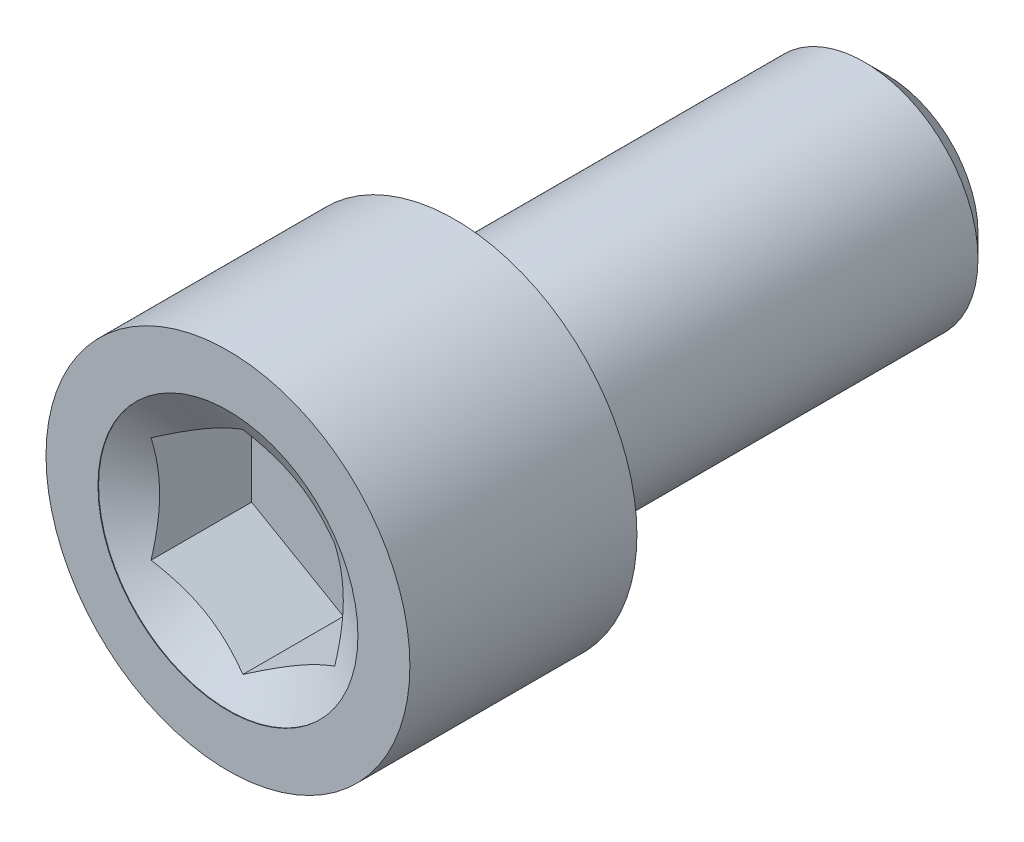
ISO-10303-21;
HEADER;
FILE_DESCRIPTION(('STEP AP214'),'2;1');
FILE_NAME('part.step','',(''),(''),'','','');
FILE_SCHEMA(('AUTOMOTIVE_DESIGN { 1 0 10303 214 1 1 1 1 }'));
ENDSEC;
DATA;
#1=APPLICATION_CONTEXT('core data for automotive mechanical design processes');
#2=APPLICATION_PROTOCOL_DEFINITION('international standard','automotive_design',2000,#1);
#3=PRODUCT_CONTEXT('',#1,'mechanical');
#4=PRODUCT('Part','Part','',(#3));
#5=PRODUCT_RELATED_PRODUCT_CATEGORY('part','',(#4));
#6=PRODUCT_DEFINITION_FORMATION('','',#4);
#7=PRODUCT_DEFINITION_CONTEXT('part definition',#1,'design');
#8=PRODUCT_DEFINITION('design','',#6,#7);
#9=PRODUCT_DEFINITION_SHAPE('','',#8);
#10=(LENGTH_UNIT() NAMED_UNIT(*) SI_UNIT(.MILLI.,.METRE.));
#11=(NAMED_UNIT(*) PLANE_ANGLE_UNIT() SI_UNIT($,.RADIAN.));
#12=(NAMED_UNIT(*) SI_UNIT($,.STERADIAN.) SOLID_ANGLE_UNIT());
#13=UNCERTAINTY_MEASURE_WITH_UNIT(LENGTH_MEASURE(1.E-05),#10,'distance_accuracy_value','');
#14=(GEOMETRIC_REPRESENTATION_CONTEXT(3) GLOBAL_UNCERTAINTY_ASSIGNED_CONTEXT((#13)) GLOBAL_UNIT_ASSIGNED_CONTEXT((#10,
#11,#12)) REPRESENTATION_CONTEXT('',''));
#15=CARTESIAN_POINT('',(0.,0.,0.));
#16=DIRECTION('',(0.,0.,1.));
#17=DIRECTION('',(1.,0.,0.));
#18=AXIS2_PLACEMENT_3D('',#15,#16,#17);
#19=CARTESIAN_POINT('',(0.,0.,0.));
#20=DIRECTION('',(0.,0.,-1.));
#21=DIRECTION('',(-1.,0.,0.));
#22=AXIS2_PLACEMENT_3D('',#19,#20,#21);
#23=PLANE('',#22);
#24=CARTESIAN_POINT('',(0.,0.,0.));
#25=DIRECTION('',(0.,0.,1.));
#26=DIRECTION('',(1.,0.,0.));
#27=AXIS2_PLACEMENT_3D('',#24,#25,#26);
#28=CIRCLE('',#27,8.001);
#29=CARTESIAN_POINT('',(8.001,0.,0.));
#30=VERTEX_POINT('',#29);
#31=EDGE_CURVE('E72',#30,#30,#28,.T.);
#32=ORIENTED_EDGE('',*,*,#31,.F.);
#33=EDGE_LOOP('',(#32));
#34=FACE_BOUND('',#33,.T.);
#35=CARTESIAN_POINT('',(0.,0.,0.));
#36=DIRECTION('',(0.,0.,-1.));
#37=DIRECTION('',(-1.,0.,0.));
#38=AXIS2_PLACEMENT_3D('',#35,#36,#37);
#39=CIRCLE('',#38,5.);
#40=CARTESIAN_POINT('',(-5.,0.,0.));
#41=VERTEX_POINT('',#40);
#42=EDGE_CURVE('E193',#41,#41,#39,.T.);
#43=ORIENTED_EDGE('',*,*,#42,.F.);
#44=EDGE_LOOP('',(#43));
#45=FACE_BOUND('',#44,.T.);
#46=ADVANCED_FACE('F14',(#34,#45),#23,.T.);
#47=CARTESIAN_POINT('',(0.,0.,9.9822));
#48=DIRECTION('',(0.,0.,1.));
#49=DIRECTION('',(1.,0.,0.));
#50=AXIS2_PLACEMENT_3D('',#47,#48,#49);
#51=PLANE('',#50);
#52=CARTESIAN_POINT('',(0.,0.,9.9822));
#53=DIRECTION('',(0.,0.,-1.));
#54=DIRECTION('',(-1.,0.,0.));
#55=AXIS2_PLACEMENT_3D('',#52,#53,#54);
#56=CIRCLE('',#55,5.715);
#57=CARTESIAN_POINT('',(-5.715,0.,9.9822));
#58=VERTEX_POINT('',#57);
#59=EDGE_CURVE('E195',#58,#58,#56,.T.);
#60=ORIENTED_EDGE('',*,*,#59,.T.);
#61=EDGE_LOOP('',(#60));
#62=FACE_BOUND('',#61,.T.);
#63=CARTESIAN_POINT('',(0.,0.,9.9822));
#64=DIRECTION('',(0.,0.,-1.));
#65=DIRECTION('',(-1.,0.,0.));
#66=AXIS2_PLACEMENT_3D('',#63,#64,#65);
#67=CIRCLE('',#66,8.001);
#68=CARTESIAN_POINT('',(-8.001,0.,9.9822));
#69=VERTEX_POINT('',#68);
#70=EDGE_CURVE('E99',#69,#69,#67,.T.);
#71=ORIENTED_EDGE('',*,*,#70,.F.);
#72=EDGE_LOOP('',(#71));
#73=FACE_BOUND('',#72,.T.);
#74=ADVANCED_FACE('F174',(#62,#73),#51,.T.);
#75=CARTESIAN_POINT('',(0.,0.,9.9822));
#76=DIRECTION('',(0.,0.,-1.));
#77=DIRECTION('',(-1.,0.,0.));
#78=AXIS2_PLACEMENT_3D('',#75,#76,#77);
#79=CYLINDRICAL_SURFACE('',#78,8.001);
#80=ORIENTED_EDGE('',*,*,#31,.T.);
#81=EDGE_LOOP('',(#80));
#82=FACE_BOUND('',#81,.T.);
#83=ORIENTED_EDGE('',*,*,#70,.T.);
#84=EDGE_LOOP('',(#83));
#85=FACE_BOUND('',#84,.T.);
#86=ADVANCED_FACE('F118',(#82,#85),#79,.T.);
#87=CARTESIAN_POINT('',(0.,0.,9.9568));
#88=DIRECTION('',(0.,0.,1.));
#89=DIRECTION('',(1.,0.,0.));
#90=AXIS2_PLACEMENT_3D('',#87,#88,#89);
#91=CONICAL_SURFACE('',#90,5.715,1.02974425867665);
#92=CARTESIAN_POINT('',(0.,0.,9.9568));
#93=DIRECTION('',(0.,0.,-1.));
#94=DIRECTION('',(-1.,0.,0.));
#95=AXIS2_PLACEMENT_3D('',#92,#93,#94);
#96=CIRCLE('',#95,5.715);
#97=CARTESIAN_POINT('',(-5.715,0.,9.9568));
#98=VERTEX_POINT('',#97);
#99=EDGE_CURVE('E78',#98,#98,#96,.T.);
#100=ORIENTED_EDGE('',*,*,#99,.F.);
#101=EDGE_LOOP('',(#100));
#102=FACE_BOUND('',#101,.T.);
#103=CARTESIAN_POINT('',(0.000200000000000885,4.66348906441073,9.32498849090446));
#104=CARTESIAN_POINT('',(-0.177918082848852,4.5606525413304,9.26317715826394));
#105=CARTESIAN_POINT('',(-0.357701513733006,4.4568545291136,9.20693667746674));
#106=CARTESIAN_POINT('',(-0.720651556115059,4.24730522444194,9.10879687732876));
#107=CARTESIAN_POINT('',(-0.903825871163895,4.14154948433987,9.06693596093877));
#108=CARTESIAN_POINT('',(-1.26771385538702,3.93145865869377,9.00200074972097));
#109=CARTESIAN_POINT('',(-1.44836169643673,3.8271615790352,8.97845256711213));
#110=CARTESIAN_POINT('',(-1.81055773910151,3.61804759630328,8.95063663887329));
#111=CARTESIAN_POINT('',(-1.99210438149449,3.51323159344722,8.94634270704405));
#112=CARTESIAN_POINT('',(-2.32970568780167,3.31831738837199,8.95663815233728));
#113=CARTESIAN_POINT('',(-2.48582334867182,3.22818281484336,8.9687051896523));
#114=CARTESIAN_POINT('',(-2.79695248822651,3.04855232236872,9.00650045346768));
#115=CARTESIAN_POINT('',(-2.95196269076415,2.95905714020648,9.03224246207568));
#116=CARTESIAN_POINT('',(-3.26376713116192,2.7790367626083,9.09642505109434));
#117=CARTESIAN_POINT('',(-3.42051564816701,2.68853796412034,9.13515404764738));
#118=CARTESIAN_POINT('',(-3.73150027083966,2.50899090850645,9.22289790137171));
#119=CARTESIAN_POINT('',(-3.88574103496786,2.41993996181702,9.27189057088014));
#120=CARTESIAN_POINT('',(-4.0388,2.33157132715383,9.32498849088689));
#121=B_SPLINE_CURVE_WITH_KNOTS('',3,(#103,#104,#105,#106,#107,#108,#109,#110,#111,#112,#113,
#114,#115,#116,#117,#118,#119,#120),.UNSPECIFIED.,.F.,.F.,(4,2,2,2,2,2,2,2,4),(0.,
0.644566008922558,1.29084029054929,1.91977596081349,2.54785600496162,3.08932428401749,
3.63133931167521,4.1862907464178,4.74005466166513),.UNSPECIFIED.);
#122=CARTESIAN_POINT('',(0.,4.66337359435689,9.32491910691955));
#123=VERTEX_POINT('',#122);
#124=CARTESIAN_POINT('',(-4.0386,2.33168679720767,9.32491910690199));
#125=VERTEX_POINT('',#124);
#126=EDGE_CURVE('E66',#123,#125,#121,.T.);
#127=ORIENTED_EDGE('',*,*,#126,.F.);
#128=CARTESIAN_POINT('',(4.0388,2.33157132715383,9.32498849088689));
#129=CARTESIAN_POINT('',(3.86068191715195,2.4344078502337,9.26317715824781));
#130=CARTESIAN_POINT('',(3.6808984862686,2.53820586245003,9.20693667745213));
#131=CARTESIAN_POINT('',(3.31794844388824,2.74775516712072,9.10879687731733));
#132=CARTESIAN_POINT('',(3.1347741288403,2.85351090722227,9.06693596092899));
#133=CARTESIAN_POINT('',(2.77088614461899,3.06360173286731,9.00200074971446));
#134=CARTESIAN_POINT('',(2.59023830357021,3.16789881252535,8.97845256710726));
#135=CARTESIAN_POINT('',(2.2280422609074,3.37701279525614,8.95063663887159));
#136=CARTESIAN_POINT('',(2.04649561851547,3.4818287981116,8.94634270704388));
#137=CARTESIAN_POINT('',(1.70889431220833,3.67674300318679,8.95663815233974));
#138=CARTESIAN_POINT('',(1.55277665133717,3.76687757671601,8.9687051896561));
#139=CARTESIAN_POINT('',(1.24164751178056,3.94650806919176,9.00650045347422));
#140=CARTESIAN_POINT('',(1.086637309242,4.03600325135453,9.03224246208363));
#141=CARTESIAN_POINT('',(0.774832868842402,4.21602362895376,9.0964250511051));
#142=CARTESIAN_POINT('',(0.618084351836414,4.30652242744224,9.13515404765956));
#143=CARTESIAN_POINT('',(0.307099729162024,4.48606948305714,9.22289790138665));
#144=CARTESIAN_POINT('',(0.152858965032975,4.57512042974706,9.27189057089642));
#145=CARTESIAN_POINT('',(-0.000199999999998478,4.66348906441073,9.32498849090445));
#146=B_SPLINE_CURVE_WITH_KNOTS('',3,(#128,#129,#130,#131,#132,#133,#134,#135,#136,#137,#138,
#139,#140,#141,#142,#143,#144,#145),.UNSPECIFIED.,.F.,.F.,(4,2,2,2,2,2,2,2,4),(0.,
0.644566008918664,1.2908402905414,1.91977596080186,2.54785600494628,3.0893242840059,
3.63133931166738,4.18629074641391,4.74005466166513),.UNSPECIFIED.);
#147=CARTESIAN_POINT('',(4.0386,2.33168679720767,9.324919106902));
#148=VERTEX_POINT('',#147);
#149=EDGE_CURVE('E68',#148,#123,#146,.T.);
#150=ORIENTED_EDGE('',*,*,#149,.F.);
#151=CARTESIAN_POINT('',(4.0386,-6.16408723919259,10.9507906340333));
#152=CARTESIAN_POINT('',(4.0386,-5.98935792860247,10.8629975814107));
#153=CARTESIAN_POINT('',(4.0386,-5.81419177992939,10.7760585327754));
#154=CARTESIAN_POINT('',(4.0386,-5.46275221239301,10.6043718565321));
#155=CARTESIAN_POINT('',(4.0386,-5.28647860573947,10.5196246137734));
#156=CARTESIAN_POINT('',(4.0386,-4.93157157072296,10.3523269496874));
#157=CARTESIAN_POINT('',(4.0386,-4.75293030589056,10.2697930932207));
#158=CARTESIAN_POINT('',(4.0386,-4.3940993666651,10.1081762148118));
#159=CARTESIAN_POINT('',(4.0386,-4.21390977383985,10.0290930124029));
#160=CARTESIAN_POINT('',(4.0386,-3.84588487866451,9.87284081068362));
#161=CARTESIAN_POINT('',(4.0386,-3.65798909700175,9.79581345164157));
#162=CARTESIAN_POINT('',(4.0386,-3.27980617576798,9.64775156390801));
#163=CARTESIAN_POINT('',(4.0386,-3.0895187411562,9.57671778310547));
#164=CARTESIAN_POINT('',(4.0386,-2.7066300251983,9.44259420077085));
#165=CARTESIAN_POINT('',(4.0386,-2.51403511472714,9.37948640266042));
#166=CARTESIAN_POINT('',(4.0386,-2.12586955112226,9.26331435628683));
#167=CARTESIAN_POINT('',(4.0386,-1.93029997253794,9.21024657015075));
#168=CARTESIAN_POINT('',(4.0386,-1.53668673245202,9.11698077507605));
#169=CARTESIAN_POINT('',(4.0386,-1.33865243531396,9.076744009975));
#170=CARTESIAN_POINT('',(4.0386,-0.940022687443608,9.01172266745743));
#171=CARTESIAN_POINT('',(4.0386,-0.739427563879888,8.98693613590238));
#172=CARTESIAN_POINT('',(4.0386,-0.339543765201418,8.9552080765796));
#173=CARTESIAN_POINT('',(4.0386,-0.14027448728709,8.94802818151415));
#174=CARTESIAN_POINT('',(4.0386,0.258130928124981,8.95152294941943));
#175=CARTESIAN_POINT('',(4.0386,0.457267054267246,8.96219897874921));
#176=CARTESIAN_POINT('',(4.0386,0.790809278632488,8.99429293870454));
#177=CARTESIAN_POINT('',(4.0386,0.925673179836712,9.01121848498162));
#178=CARTESIAN_POINT('',(4.0386,1.19432190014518,9.05219992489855));
#179=CARTESIAN_POINT('',(4.0386,1.32810656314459,9.07625683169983));
#180=CARTESIAN_POINT('',(4.0386,1.72772112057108,9.15794645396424));
#181=CARTESIAN_POINT('',(4.0386,1.99162896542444,9.22507846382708));
#182=CARTESIAN_POINT('',(4.0386,2.38633460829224,9.3406074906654));
#183=CARTESIAN_POINT('',(4.0386,2.51924927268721,9.38216281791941));
#184=CARTESIAN_POINT('',(4.0386,2.78365711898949,9.46935602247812));
#185=CARTESIAN_POINT('',(4.0386,2.91515109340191,9.51499147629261));
#186=CARTESIAN_POINT('',(4.0386,3.17687398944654,9.60968567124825));
#187=CARTESIAN_POINT('',(4.0386,3.30710304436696,9.65874404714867));
#188=CARTESIAN_POINT('',(4.0386,3.56645930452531,9.75974066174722));
#189=CARTESIAN_POINT('',(4.0386,3.69558633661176,9.81167934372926));
#190=CARTESIAN_POINT('',(4.0386,4.05002248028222,9.95810255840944));
#191=CARTESIAN_POINT('',(4.0386,4.27429832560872,10.0550864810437));
#192=CARTESIAN_POINT('',(4.0386,4.72041043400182,10.2545309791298));
#193=CARTESIAN_POINT('',(4.0386,4.94224641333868,10.3569921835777));
#194=CARTESIAN_POINT('',(4.0386,5.3840233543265,10.5660744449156));
#195=CARTESIAN_POINT('',(4.0386,5.60396373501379,10.6726967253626));
#196=CARTESIAN_POINT('',(4.0386,6.04228216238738,10.8891121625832));
#197=CARTESIAN_POINT('',(4.0386,6.26066016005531,10.9989054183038));
#198=CARTESIAN_POINT('',(4.0386,6.69651370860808,11.2211457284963));
#199=CARTESIAN_POINT('',(4.0386,6.91398717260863,11.3335968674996));
#200=CARTESIAN_POINT('',(4.0386,7.34790616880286,11.5604672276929));
#201=CARTESIAN_POINT('',(4.0386,7.56435168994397,11.6748864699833));
#202=CARTESIAN_POINT('',(4.0386,8.21234215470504,12.0204438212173));
#203=CARTESIAN_POINT('',(4.0386,8.64263452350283,12.2539297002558));
#204=CARTESIAN_POINT('',(4.0386,9.45396690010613,12.6993040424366));
#205=CARTESIAN_POINT('',(4.0386,9.83524506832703,12.9107607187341));
#206=CARTESIAN_POINT('',(4.0386,10.5964653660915,13.3361160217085));
#207=CARTESIAN_POINT('',(4.0386,10.9764074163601,13.5500147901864));
#208=CARTESIAN_POINT('',(4.0386,11.7339661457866,13.9788853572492));
#209=CARTESIAN_POINT('',(4.0386,12.1115863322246,14.1938509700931));
#210=CARTESIAN_POINT('',(4.0386,12.8659956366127,14.6251701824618));
#211=CARTESIAN_POINT('',(4.0386,13.2427848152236,14.841523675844));
#212=CARTESIAN_POINT('',(4.0386,13.6192807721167,15.0583831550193));
#213=B_SPLINE_CURVE_WITH_KNOTS('',3,(#151,#152,#153,#154,#155,#156,#157,#158,#159,#160,#161,
#162,#163,#164,#165,#166,#167,#168,#169,#170,#171,#172,#173,#174,#175,#176,#177,#178,#179,#180,
#181,#182,#183,#184,#185,#186,#187,#188,#189,#190,#191,#192,#193,#194,#195,#196,#197,#198,#199,
#200,#201,#202,#203,#204,#205,#206,#207,#208,#209,#210,#211,#212),.UNSPECIFIED.,.F.,.F.,(4,2,2,
2,2,2,2,2,2,2,2,2,2,2,2,2,2,2,2,2,2,2,2,2,2,2,2,2,2,2,4),(0.,0.586643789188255,1.17338989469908,
1.76371711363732,2.35401342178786,2.96314877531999,3.57236002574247,4.18016199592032,
4.7877493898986,5.39348378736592,5.99914155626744,6.59655321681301,7.19401059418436,
7.6015836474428,8.00921463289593,8.82502515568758,9.2427675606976,9.66026346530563,
10.0777148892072,10.4952307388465,11.2281615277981,11.9611766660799,12.6944089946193,
13.4276642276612,14.1621308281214,14.896605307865,16.3652387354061,17.6731986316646,
18.9812348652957,20.2847903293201,21.5882472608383),.UNSPECIFIED.);
#214=CARTESIAN_POINT('',(4.0386,-2.33168679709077,9.32491910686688));
#215=VERTEX_POINT('',#214);
#216=EDGE_CURVE('E77',#215,#148,#213,.T.);
#217=ORIENTED_EDGE('',*,*,#216,.F.);
#218=CARTESIAN_POINT('',(-0.000199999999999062,-4.66348906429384,9.32498849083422));
#219=CARTESIAN_POINT('',(0.177918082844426,-4.56065254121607,9.26317715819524));
#220=CARTESIAN_POINT('',(0.35770151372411,-4.45685452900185,9.20693667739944));
#221=CARTESIAN_POINT('',(0.720651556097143,-4.24730522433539,9.10879687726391));
#222=CARTESIAN_POINT('',(0.903825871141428,-4.14154948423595,9.06693596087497));
#223=CARTESIAN_POINT('',(1.26771385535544,-3.93145865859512,9.0020007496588));
#224=CARTESIAN_POINT('',(1.44836169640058,-3.82716157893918,8.97845256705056));
#225=CARTESIAN_POINT('',(1.8105577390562,-3.61804759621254,8.95063663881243));
#226=CARTESIAN_POINT('',(1.99210438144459,-3.51323159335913,8.94634270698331));
#227=CARTESIAN_POINT('',(2.32970568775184,-3.31831738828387,8.95663815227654));
#228=CARTESIAN_POINT('',(2.48582334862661,-3.22818281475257,8.96870518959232));
#229=CARTESIAN_POINT('',(2.79695248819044,-3.04855232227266,9.00650045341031));
#230=CARTESIAN_POINT('',(2.95196269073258,-2.95905714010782,9.03224246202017));
#231=CARTESIAN_POINT('',(3.26376713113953,-2.77903676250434,9.09642505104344));
#232=CARTESIAN_POINT('',(3.42051564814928,-2.68853796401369,9.13515404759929));
#233=CARTESIAN_POINT('',(3.73150027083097,-2.50899090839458,9.22289790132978));
#234=CARTESIAN_POINT('',(3.88574103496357,-2.41993996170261,9.27189057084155));
#235=CARTESIAN_POINT('',(4.0388,-2.33157132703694,9.32498849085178));
#236=B_SPLINE_CURVE_WITH_KNOTS('',3,(#218,#219,#220,#221,#222,#223,#224,#225,#226,#227,#228,
#229,#230,#231,#232,#233,#234,#235),.UNSPECIFIED.,.F.,.F.,(4,2,2,2,2,2,2,2,4),(0.,
0.644566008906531,1.29084029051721,1.91977596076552,2.54785600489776,3.0893242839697,
3.6313393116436,4.18629074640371,4.74005466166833),.UNSPECIFIED.);
#237=CARTESIAN_POINT('',(0.,-4.66337359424,9.32491910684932));
#238=VERTEX_POINT('',#237);
#239=EDGE_CURVE('E139',#238,#215,#236,.T.);
#240=ORIENTED_EDGE('',*,*,#239,.F.);
#241=CARTESIAN_POINT('',(-4.0388,-2.33157132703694,9.32498849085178));
#242=CARTESIAN_POINT('',(-3.86068191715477,-2.43440785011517,9.26317715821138));
#243=CARTESIAN_POINT('',(-3.68089848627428,-2.53820586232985,9.20693667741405));
#244=CARTESIAN_POINT('',(-3.31794844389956,-2.74775516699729,9.10879687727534));
#245=CARTESIAN_POINT('',(-3.13477412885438,-2.85351090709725,9.06693596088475));
#246=CARTESIAN_POINT('',(-2.77088614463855,-3.06360173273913,9.00200074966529));
#247=CARTESIAN_POINT('',(-2.59023830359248,-3.1678988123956,8.97845256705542));
#248=CARTESIAN_POINT('',(-2.22804226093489,-3.37701279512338,8.95063663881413));
#249=CARTESIAN_POINT('',(-2.04649561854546,-3.48182879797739,8.94634270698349));
#250=CARTESIAN_POINT('',(-1.70889431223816,-3.67674300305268,8.95663815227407));
#251=CARTESIAN_POINT('',(-1.55277665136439,-3.7668775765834,8.96870518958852));
#252=CARTESIAN_POINT('',(-1.2416475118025,-3.9465080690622,9.00650045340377));
#253=CARTESIAN_POINT('',(-1.08663730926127,-4.03600325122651,9.03224246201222));
#254=CARTESIAN_POINT('',(-0.774832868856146,-4.21602362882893,9.09642505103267));
#255=CARTESIAN_POINT('',(-0.618084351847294,-4.30652242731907,9.1351540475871));
#256=CARTESIAN_POINT('',(-0.30709972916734,-4.48606948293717,9.22289790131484));
#257=CARTESIAN_POINT('',(-0.152858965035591,-4.57512042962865,9.27189057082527));
#258=CARTESIAN_POINT('',(0.000200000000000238,-4.66348906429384,9.32498849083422));
#259=B_SPLINE_CURVE_WITH_KNOTS('',3,(#241,#242,#243,#244,#245,#246,#247,#248,#249,#250,#251,
#252,#253,#254,#255,#256,#257,#258),.UNSPECIFIED.,.F.,.F.,(4,2,2,2,2,2,2,2,4),(0.,
0.644566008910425,1.2908402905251,1.91977596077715,2.54785600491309,3.08932428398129,
3.63133931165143,4.1862907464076,4.74005466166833),.UNSPECIFIED.);
#260=CARTESIAN_POINT('',(-4.0386,-2.33168679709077,9.32491910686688));
#261=VERTEX_POINT('',#260);
#262=EDGE_CURVE('E146',#261,#238,#259,.T.);
#263=ORIENTED_EDGE('',*,*,#262,.F.);
#264=CARTESIAN_POINT('',(-4.0386,-6.16408723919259,10.9507906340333));
#265=CARTESIAN_POINT('',(-4.0386,-5.98935792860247,10.8629975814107));
#266=CARTESIAN_POINT('',(-4.0386,-5.81419177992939,10.7760585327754));
#267=CARTESIAN_POINT('',(-4.0386,-5.46275221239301,10.6043718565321));
#268=CARTESIAN_POINT('',(-4.0386,-5.28647860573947,10.5196246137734));
#269=CARTESIAN_POINT('',(-4.0386,-4.93157157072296,10.3523269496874));
#270=CARTESIAN_POINT('',(-4.0386,-4.75293030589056,10.2697930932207));
#271=CARTESIAN_POINT('',(-4.0386,-4.3940993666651,10.1081762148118));
#272=CARTESIAN_POINT('',(-4.0386,-4.21390977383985,10.0290930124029));
#273=CARTESIAN_POINT('',(-4.0386,-3.84588487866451,9.87284081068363));
#274=CARTESIAN_POINT('',(-4.0386,-3.65798909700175,9.79581345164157));
#275=CARTESIAN_POINT('',(-4.0386,-3.27980617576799,9.64775156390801));
#276=CARTESIAN_POINT('',(-4.0386,-3.0895187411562,9.57671778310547));
#277=CARTESIAN_POINT('',(-4.0386,-2.7066300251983,9.44259420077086));
#278=CARTESIAN_POINT('',(-4.0386,-2.51403511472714,9.37948640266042));
#279=CARTESIAN_POINT('',(-4.0386,-2.12586955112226,9.26331435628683));
#280=CARTESIAN_POINT('',(-4.0386,-1.93029997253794,9.21024657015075));
#281=CARTESIAN_POINT('',(-4.0386,-1.53668673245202,9.11698077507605));
#282=CARTESIAN_POINT('',(-4.0386,-1.33865243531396,9.076744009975));
#283=CARTESIAN_POINT('',(-4.0386,-0.940022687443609,9.01172266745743));
#284=CARTESIAN_POINT('',(-4.0386,-0.739427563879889,8.98693613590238));
#285=CARTESIAN_POINT('',(-4.0386,-0.33954376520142,8.9552080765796));
#286=CARTESIAN_POINT('',(-4.0386,-0.140274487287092,8.94802818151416));
#287=CARTESIAN_POINT('',(-4.0386,0.258130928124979,8.95152294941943));
#288=CARTESIAN_POINT('',(-4.0386,0.457267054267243,8.96219897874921));
#289=CARTESIAN_POINT('',(-4.0386,0.790809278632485,8.99429293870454));
#290=CARTESIAN_POINT('',(-4.0386,0.925673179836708,9.01121848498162));
#291=CARTESIAN_POINT('',(-4.0386,1.19432190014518,9.05219992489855));
#292=CARTESIAN_POINT('',(-4.0386,1.32810656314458,9.07625683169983));
#293=CARTESIAN_POINT('',(-4.0386,1.72772112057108,9.15794645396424));
#294=CARTESIAN_POINT('',(-4.0386,1.99162896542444,9.22507846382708));
#295=CARTESIAN_POINT('',(-4.0386,2.38633460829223,9.3406074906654));
#296=CARTESIAN_POINT('',(-4.0386,2.5192492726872,9.38216281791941));
#297=CARTESIAN_POINT('',(-4.0386,2.78365711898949,9.46935602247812));
#298=CARTESIAN_POINT('',(-4.0386,2.91515109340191,9.51499147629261));
#299=CARTESIAN_POINT('',(-4.0386,3.17687398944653,9.60968567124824));
#300=CARTESIAN_POINT('',(-4.0386,3.30710304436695,9.65874404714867));
#301=CARTESIAN_POINT('',(-4.0386,3.5664593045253,9.75974066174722));
#302=CARTESIAN_POINT('',(-4.0386,3.69558633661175,9.81167934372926));
#303=CARTESIAN_POINT('',(-4.0386,4.05002248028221,9.95810255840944));
#304=CARTESIAN_POINT('',(-4.0386,4.27429832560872,10.0550864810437));
#305=CARTESIAN_POINT('',(-4.0386,4.72041043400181,10.2545309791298));
#306=CARTESIAN_POINT('',(-4.0386,4.94224641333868,10.3569921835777));
#307=CARTESIAN_POINT('',(-4.0386,5.38402335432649,10.5660744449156));
#308=CARTESIAN_POINT('',(-4.0386,5.60396373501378,10.6726967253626));
#309=CARTESIAN_POINT('',(-4.0386,6.04228216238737,10.8891121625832));
#310=CARTESIAN_POINT('',(-4.0386,6.2606601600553,10.9989054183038));
#311=CARTESIAN_POINT('',(-4.0386,6.69651370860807,11.2211457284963));
#312=CARTESIAN_POINT('',(-4.0386,6.91398717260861,11.3335968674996));
#313=CARTESIAN_POINT('',(-4.0386,7.34790616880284,11.5604672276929));
#314=CARTESIAN_POINT('',(-4.0386,7.56435168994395,11.6748864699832));
#315=CARTESIAN_POINT('',(-4.0386,8.21234215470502,12.0204438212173));
#316=CARTESIAN_POINT('',(-4.0386,8.64263452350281,12.2539297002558));
#317=CARTESIAN_POINT('',(-4.0386,9.4539669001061,12.6993040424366));
#318=CARTESIAN_POINT('',(-4.0386,9.83524506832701,12.9107607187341));
#319=CARTESIAN_POINT('',(-4.0386,10.5964653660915,13.3361160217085));
#320=CARTESIAN_POINT('',(-4.0386,10.9764074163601,13.5500147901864));
#321=CARTESIAN_POINT('',(-4.0386,11.7339661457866,13.9788853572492));
#322=CARTESIAN_POINT('',(-4.0386,12.1115863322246,14.1938509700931));
#323=CARTESIAN_POINT('',(-4.0386,12.8659956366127,14.6251701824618));
#324=CARTESIAN_POINT('',(-4.0386,13.2427848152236,14.841523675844));
#325=CARTESIAN_POINT('',(-4.0386,13.6192807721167,15.0583831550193));
#326=B_SPLINE_CURVE_WITH_KNOTS('',3,(#264,#265,#266,#267,#268,#269,#270,#271,#272,#273,#274,
#275,#276,#277,#278,#279,#280,#281,#282,#283,#284,#285,#286,#287,#288,#289,#290,#291,#292,#293,
#294,#295,#296,#297,#298,#299,#300,#301,#302,#303,#304,#305,#306,#307,#308,#309,#310,#311,#312,
#313,#314,#315,#316,#317,#318,#319,#320,#321,#322,#323,#324,#325),.UNSPECIFIED.,.F.,.F.,(4,2,2,
2,2,2,2,2,2,2,2,2,2,2,2,2,2,2,2,2,2,2,2,2,2,2,2,2,2,2,4),(0.,0.586643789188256,1.17338989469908,
1.76371711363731,2.35401342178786,2.96314877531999,3.57236002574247,4.18016199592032,
4.7877493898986,5.39348378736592,5.99914155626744,6.59655321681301,7.19401059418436,
7.60158364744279,8.00921463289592,8.82502515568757,9.2427675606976,9.66026346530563,
10.0777148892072,10.4952307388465,11.228161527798,11.9611766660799,12.6944089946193,
13.4276642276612,14.1621308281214,14.896605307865,16.365238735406,17.6731986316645,
18.9812348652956,20.2847903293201,21.5882472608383),.UNSPECIFIED.);
#327=EDGE_CURVE('E29',#125,#261,#326,.F.);
#328=ORIENTED_EDGE('',*,*,#327,.F.);
#329=EDGE_LOOP('',(#127,#150,#217,#240,#263,#328));
#330=FACE_BOUND('',#329,.T.);
#331=ADVANCED_FACE('F67',(#102,#330),#91,.F.);
#332=CARTESIAN_POINT('',(0.,0.,9.9822));
#333=DIRECTION('',(0.,0.,-1.));
#334=DIRECTION('',(-1.,0.,0.));
#335=AXIS2_PLACEMENT_3D('',#332,#333,#334);
#336=CYLINDRICAL_SURFACE('',#335,5.715);
#337=ORIENTED_EDGE('',*,*,#99,.T.);
#338=EDGE_LOOP('',(#337));
#339=FACE_BOUND('',#338,.T.);
#340=ORIENTED_EDGE('',*,*,#59,.F.);
#341=EDGE_LOOP('',(#340));
#342=FACE_BOUND('',#341,.T.);
#343=ADVANCED_FACE('F117',(#339,#342),#336,.F.);
#344=CARTESIAN_POINT('',(-4.0386,-2.33168679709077,4.9022));
#345=DIRECTION('',(0.,0.,1.));
#346=DIRECTION('',(1.,0.,0.));
#347=AXIS2_PLACEMENT_3D('',#344,#345,#346);
#348=PLANE('',#347);
#349=DIRECTION('',(0.,-1.,0.));
#350=VECTOR('',#349,1.);
#351=CARTESIAN_POINT('',(-4.0386,2.33168679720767,4.9022));
#352=LINE('',#351,#350);
#353=CARTESIAN_POINT('',(-4.0386,2.33168679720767,4.9022));
#354=VERTEX_POINT('',#353);
#355=CARTESIAN_POINT('',(-4.0386,-2.33168679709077,4.9022));
#356=VERTEX_POINT('',#355);
#357=EDGE_CURVE('E218',#354,#356,#352,.T.);
#358=ORIENTED_EDGE('',*,*,#357,.T.);
#359=DIRECTION('',(0.866025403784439,-0.5,0.));
#360=VECTOR('',#359,1.);
#361=CARTESIAN_POINT('',(-4.0386,-2.33168679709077,4.9022));
#362=LINE('',#361,#360);
#363=CARTESIAN_POINT('',(0.,-4.66337359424,4.9022));
#364=VERTEX_POINT('',#363);
#365=EDGE_CURVE('E221',#356,#364,#362,.T.);
#366=ORIENTED_EDGE('',*,*,#365,.T.);
#367=DIRECTION('',(0.866025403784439,0.5,0.));
#368=VECTOR('',#367,1.);
#369=CARTESIAN_POINT('',(0.,-4.66337359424,4.9022));
#370=LINE('',#369,#368);
#371=CARTESIAN_POINT('',(4.0386,-2.33168679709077,4.9022));
#372=VERTEX_POINT('',#371);
#373=EDGE_CURVE('E223',#364,#372,#370,.T.);
#374=ORIENTED_EDGE('',*,*,#373,.T.);
#375=DIRECTION('',(0.,1.,0.));
#376=VECTOR('',#375,1.);
#377=CARTESIAN_POINT('',(4.0386,-2.33168679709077,4.9022));
#378=LINE('',#377,#376);
#379=CARTESIAN_POINT('',(4.0386,2.33168679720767,4.9022));
#380=VERTEX_POINT('',#379);
#381=EDGE_CURVE('E227',#372,#380,#378,.T.);
#382=ORIENTED_EDGE('',*,*,#381,.T.);
#383=DIRECTION('',(-0.866025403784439,0.5,0.));
#384=VECTOR('',#383,1.);
#385=CARTESIAN_POINT('',(4.0386,2.33168679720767,4.9022));
#386=LINE('',#385,#384);
#387=CARTESIAN_POINT('',(0.,4.66337359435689,4.9022));
#388=VERTEX_POINT('',#387);
#389=EDGE_CURVE('E229',#380,#388,#386,.T.);
#390=ORIENTED_EDGE('',*,*,#389,.T.);
#391=DIRECTION('',(-0.866025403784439,-0.5,0.));
#392=VECTOR('',#391,1.);
#393=CARTESIAN_POINT('',(0.,4.66337359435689,4.9022));
#394=LINE('',#393,#392);
#395=EDGE_CURVE('E83',#388,#354,#394,.T.);
#396=ORIENTED_EDGE('',*,*,#395,.T.);
#397=EDGE_LOOP('',(#358,#366,#374,#382,#390,#396));
#398=FACE_BOUND('',#397,.T.);
#399=ADVANCED_FACE('F204',(#398),#348,.T.);
#400=CARTESIAN_POINT('',(0.,4.66337359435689,4.9022));
#401=DIRECTION('',(-0.5,0.866025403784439,0.));
#402=DIRECTION('',(0.866025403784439,0.5,0.));
#403=AXIS2_PLACEMENT_3D('',#400,#401,#402);
#404=PLANE('',#403);
#405=DIRECTION('',(0.,0.,1.));
#406=VECTOR('',#405,1.);
#407=CARTESIAN_POINT('',(0.,4.66337359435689,4.9022));
#408=LINE('',#407,#406);
#409=EDGE_CURVE('E37',#388,#123,#408,.T.);
#410=ORIENTED_EDGE('',*,*,#409,.T.);
#411=ORIENTED_EDGE('',*,*,#126,.T.);
#412=DIRECTION('',(0.,0.,1.));
#413=VECTOR('',#412,1.);
#414=CARTESIAN_POINT('',(-4.0386,2.33168679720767,4.9022));
#415=LINE('',#414,#413);
#416=EDGE_CURVE('E84',#354,#125,#415,.T.);
#417=ORIENTED_EDGE('',*,*,#416,.F.);
#418=ORIENTED_EDGE('',*,*,#395,.F.);
#419=EDGE_LOOP('',(#410,#411,#417,#418));
#420=FACE_BOUND('',#419,.T.);
#421=ADVANCED_FACE('F81',(#420),#404,.F.);
#422=CARTESIAN_POINT('',(4.0386,2.33168679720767,4.9022));
#423=DIRECTION('',(0.5,0.866025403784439,0.));
#424=DIRECTION('',(0.866025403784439,-0.5,0.));
#425=AXIS2_PLACEMENT_3D('',#422,#423,#424);
#426=PLANE('',#425);
#427=DIRECTION('',(0.,0.,1.));
#428=VECTOR('',#427,1.);
#429=CARTESIAN_POINT('',(4.0386,2.33168679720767,4.9022));
#430=LINE('',#429,#428);
#431=EDGE_CURVE('E76',#380,#148,#430,.T.);
#432=ORIENTED_EDGE('',*,*,#431,.T.);
#433=ORIENTED_EDGE('',*,*,#149,.T.);
#434=ORIENTED_EDGE('',*,*,#409,.F.);
#435=ORIENTED_EDGE('',*,*,#389,.F.);
#436=EDGE_LOOP('',(#432,#433,#434,#435));
#437=FACE_BOUND('',#436,.T.);
#438=ADVANCED_FACE('F75',(#437),#426,.F.);
#439=CARTESIAN_POINT('',(4.0386,-2.33168679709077,4.9022));
#440=DIRECTION('',(1.,0.,0.));
#441=DIRECTION('',(0.,0.,-1.));
#442=AXIS2_PLACEMENT_3D('',#439,#440,#441);
#443=PLANE('',#442);
#444=DIRECTION('',(0.,0.,1.));
#445=VECTOR('',#444,1.);
#446=CARTESIAN_POINT('',(4.0386,-2.33168679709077,4.9022));
#447=LINE('',#446,#445);
#448=EDGE_CURVE('E86',#372,#215,#447,.T.);
#449=ORIENTED_EDGE('',*,*,#448,.T.);
#450=ORIENTED_EDGE('',*,*,#216,.T.);
#451=ORIENTED_EDGE('',*,*,#431,.F.);
#452=ORIENTED_EDGE('',*,*,#381,.F.);
#453=EDGE_LOOP('',(#449,#450,#451,#452));
#454=FACE_BOUND('',#453,.T.);
#455=ADVANCED_FACE('F232',(#454),#443,.F.);
#456=CARTESIAN_POINT('',(0.,-4.66337359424,4.9022));
#457=DIRECTION('',(0.5,-0.866025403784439,0.));
#458=DIRECTION('',(-0.866025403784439,-0.5,0.));
#459=AXIS2_PLACEMENT_3D('',#456,#457,#458);
#460=PLANE('',#459);
#461=DIRECTION('',(0.,0.,1.));
#462=VECTOR('',#461,1.);
#463=CARTESIAN_POINT('',(0.,-4.66337359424,4.9022));
#464=LINE('',#463,#462);
#465=EDGE_CURVE('E94',#364,#238,#464,.T.);
#466=ORIENTED_EDGE('',*,*,#465,.T.);
#467=ORIENTED_EDGE('',*,*,#239,.T.);
#468=ORIENTED_EDGE('',*,*,#448,.F.);
#469=ORIENTED_EDGE('',*,*,#373,.F.);
#470=EDGE_LOOP('',(#466,#467,#468,#469));
#471=FACE_BOUND('',#470,.T.);
#472=ADVANCED_FACE('F163',(#471),#460,.F.);
#473=CARTESIAN_POINT('',(-4.0386,-2.33168679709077,4.9022));
#474=DIRECTION('',(-0.5,-0.866025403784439,0.));
#475=DIRECTION('',(-0.866025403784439,0.5,0.));
#476=AXIS2_PLACEMENT_3D('',#473,#474,#475);
#477=PLANE('',#476);
#478=DIRECTION('',(0.,0.,1.));
#479=VECTOR('',#478,1.);
#480=CARTESIAN_POINT('',(-4.0386,-2.33168679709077,4.9022));
#481=LINE('',#480,#479);
#482=EDGE_CURVE('E97',#356,#261,#481,.T.);
#483=ORIENTED_EDGE('',*,*,#482,.T.);
#484=ORIENTED_EDGE('',*,*,#262,.T.);
#485=ORIENTED_EDGE('',*,*,#465,.F.);
#486=ORIENTED_EDGE('',*,*,#365,.F.);
#487=EDGE_LOOP('',(#483,#484,#485,#486));
#488=FACE_BOUND('',#487,.T.);
#489=ADVANCED_FACE('F159',(#488),#477,.F.);
#490=CARTESIAN_POINT('',(-4.0386,2.33168679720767,4.9022));
#491=DIRECTION('',(-1.,0.,0.));
#492=DIRECTION('',(0.,0.,1.));
#493=AXIS2_PLACEMENT_3D('',#490,#491,#492);
#494=PLANE('',#493);
#495=ORIENTED_EDGE('',*,*,#416,.T.);
#496=ORIENTED_EDGE('',*,*,#327,.T.);
#497=ORIENTED_EDGE('',*,*,#482,.F.);
#498=ORIENTED_EDGE('',*,*,#357,.F.);
#499=EDGE_LOOP('',(#495,#496,#497,#498));
#500=FACE_BOUND('',#499,.T.);
#501=ADVANCED_FACE('F162',(#500),#494,.F.);
#502=CARTESIAN_POINT('',(0.,0.,-33.141335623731));
#503=DIRECTION('',(0.,0.,1.));
#504=DIRECTION('',(1.,0.,0.));
#505=AXIS2_PLACEMENT_3D('',#502,#503,#504);
#506=CYLINDRICAL_SURFACE('',#505,5.);
#507=CARTESIAN_POINT('',(0.,0.,-17.9992));
#508=DIRECTION('',(0.,0.,-1.));
#509=DIRECTION('',(-1.,0.,0.));
#510=AXIS2_PLACEMENT_3D('',#507,#508,#509);
#511=CIRCLE('',#510,5.);
#512=CARTESIAN_POINT('',(-5.,0.,-17.9992));
#513=VERTEX_POINT('',#512);
#514=EDGE_CURVE('E9',#513,#513,#511,.F.);
#515=ORIENTED_EDGE('',*,*,#514,.T.);
#516=EDGE_LOOP('',(#515));
#517=FACE_BOUND('',#516,.T.);
#518=ORIENTED_EDGE('',*,*,#42,.T.);
#519=EDGE_LOOP('',(#518));
#520=FACE_BOUND('',#519,.T.);
#521=ADVANCED_FACE('F120',(#517,#520),#506,.T.);
#522=CARTESIAN_POINT('',(0.,0.,-18.9992));
#523=DIRECTION('',(0.,0.,-1.));
#524=DIRECTION('',(-1.,0.,0.));
#525=AXIS2_PLACEMENT_3D('',#522,#523,#524);
#526=PLANE('',#525);
#527=CARTESIAN_POINT('',(0.,0.,-18.9992));
#528=DIRECTION('',(0.,0.,-1.));
#529=DIRECTION('',(-1.,0.,0.));
#530=AXIS2_PLACEMENT_3D('',#527,#528,#529);
#531=CIRCLE('',#530,4.);
#532=CARTESIAN_POINT('',(-4.,0.,-18.9992));
#533=VERTEX_POINT('',#532);
#534=EDGE_CURVE('E22',#533,#533,#531,.T.);
#535=ORIENTED_EDGE('',*,*,#534,.T.);
#536=EDGE_LOOP('',(#535));
#537=FACE_BOUND('',#536,.T.);
#538=ADVANCED_FACE('F170',(#537),#526,.T.);
#539=CARTESIAN_POINT('',(0.,0.,-18.9992));
#540=DIRECTION('',(0.,0.,1.));
#541=DIRECTION('',(1.,0.,0.));
#542=AXIS2_PLACEMENT_3D('',#539,#540,#541);
#543=CONICAL_SURFACE('',#542,4.,0.785398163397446);
#544=ORIENTED_EDGE('',*,*,#514,.F.);
#545=EDGE_LOOP('',(#544));
#546=FACE_BOUND('',#545,.T.);
#547=ORIENTED_EDGE('',*,*,#534,.F.);
#548=EDGE_LOOP('',(#547));
#549=FACE_BOUND('',#548,.T.);
#550=ADVANCED_FACE('F16',(#546,#549),#543,.T.);
#551=CLOSED_SHELL('',(#46,#74,#86,#331,#343,#399,#421,#438,#455,#472,#489,#501,#521,#538,#550));
#552=MANIFOLD_SOLID_BREP('B1',#551);
#553=ADVANCED_BREP_SHAPE_REPRESENTATION('',(#18,#552),#14);
#554=SHAPE_DEFINITION_REPRESENTATION(#9,#553);
ENDSEC;
END-ISO-10303-21;
